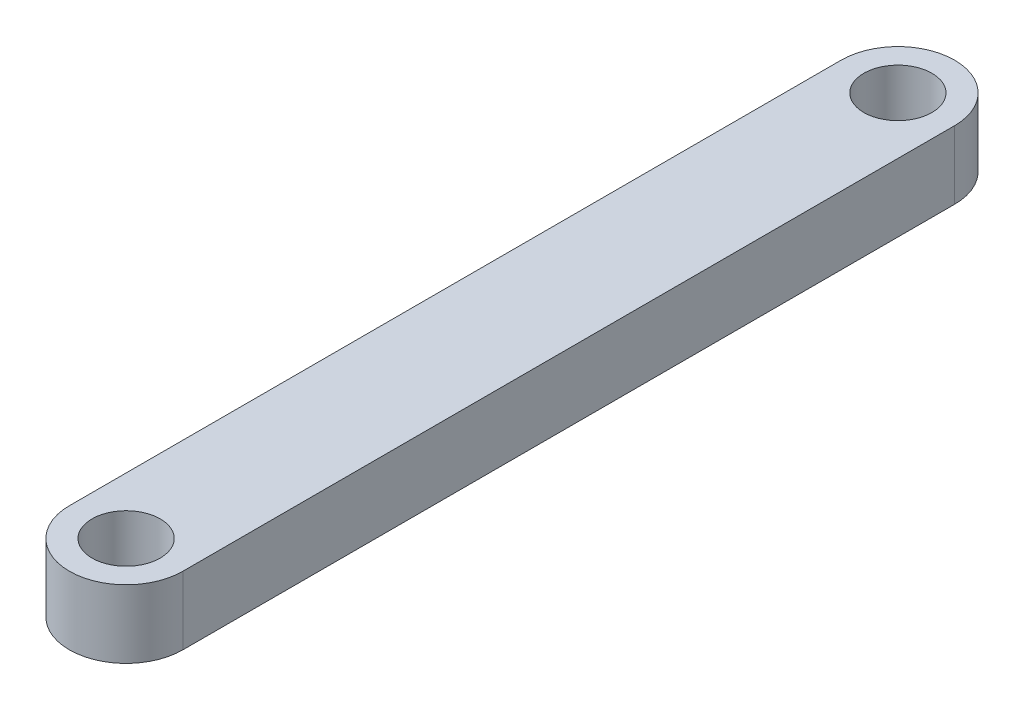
ISO-10303-21;
HEADER;
FILE_DESCRIPTION(('STEP AP214'),'2;1');
FILE_NAME('part.step','',(''),(''),'','','');
FILE_SCHEMA(('AUTOMOTIVE_DESIGN { 1 0 10303 214 1 1 1 1 }'));
ENDSEC;
DATA;
#1=APPLICATION_CONTEXT('core data for automotive mechanical design processes');
#2=APPLICATION_PROTOCOL_DEFINITION('international standard','automotive_design',2000,#1);
#3=PRODUCT_CONTEXT('',#1,'mechanical');
#4=PRODUCT('Part','Part','',(#3));
#5=PRODUCT_RELATED_PRODUCT_CATEGORY('part','',(#4));
#6=PRODUCT_DEFINITION_FORMATION('','',#4);
#7=PRODUCT_DEFINITION_CONTEXT('part definition',#1,'design');
#8=PRODUCT_DEFINITION('design','',#6,#7);
#9=PRODUCT_DEFINITION_SHAPE('','',#8);
#10=(LENGTH_UNIT() NAMED_UNIT(*) SI_UNIT(.MILLI.,.METRE.));
#11=(NAMED_UNIT(*) PLANE_ANGLE_UNIT() SI_UNIT($,.RADIAN.));
#12=(NAMED_UNIT(*) SI_UNIT($,.STERADIAN.) SOLID_ANGLE_UNIT());
#13=UNCERTAINTY_MEASURE_WITH_UNIT(LENGTH_MEASURE(1.E-05),#10,'distance_accuracy_value','');
#14=(GEOMETRIC_REPRESENTATION_CONTEXT(3) GLOBAL_UNCERTAINTY_ASSIGNED_CONTEXT((#13)) GLOBAL_UNIT_ASSIGNED_CONTEXT((#10,
#11,#12)) REPRESENTATION_CONTEXT('',''));
#15=CARTESIAN_POINT('',(0.,0.,0.));
#16=DIRECTION('',(0.,0.,1.));
#17=DIRECTION('',(1.,0.,0.));
#18=AXIS2_PLACEMENT_3D('',#15,#16,#17);
#19=CARTESIAN_POINT('',(0.,3.,-34.));
#20=DIRECTION('',(0.,1.,0.));
#21=DIRECTION('',(0.,0.,1.));
#22=AXIS2_PLACEMENT_3D('',#19,#20,#21);
#23=PLANE('',#22);
#24=CARTESIAN_POINT('',(0.,3.,0.));
#25=DIRECTION('',(0.,1.,0.));
#26=DIRECTION('',(0.,0.,1.));
#27=AXIS2_PLACEMENT_3D('',#24,#25,#26);
#28=CIRCLE('',#27,1.5);
#29=CARTESIAN_POINT('',(0.,3.,1.5));
#30=VERTEX_POINT('',#29);
#31=EDGE_CURVE('E100',#30,#30,#28,.T.);
#32=ORIENTED_EDGE('',*,*,#31,.F.);
#33=EDGE_LOOP('',(#32));
#34=FACE_BOUND('',#33,.T.);
#35=CARTESIAN_POINT('',(0.,3.,-34.));
#36=DIRECTION('',(0.,1.,0.));
#37=DIRECTION('',(0.,0.,1.));
#38=AXIS2_PLACEMENT_3D('',#35,#36,#37);
#39=CIRCLE('',#38,2.5);
#40=CARTESIAN_POINT('',(2.5,3.,-34.));
#41=VERTEX_POINT('',#40);
#42=CARTESIAN_POINT('',(-2.5,3.,-34.));
#43=VERTEX_POINT('',#42);
#44=EDGE_CURVE('E85',#41,#43,#39,.T.);
#45=ORIENTED_EDGE('',*,*,#44,.T.);
#46=DIRECTION('',(0.,0.,1.));
#47=VECTOR('',#46,1.);
#48=CARTESIAN_POINT('',(-2.5,3.,-34.));
#49=LINE('',#48,#47);
#50=CARTESIAN_POINT('',(-2.5,3.,0.));
#51=VERTEX_POINT('',#50);
#52=EDGE_CURVE('E80',#43,#51,#49,.T.);
#53=ORIENTED_EDGE('',*,*,#52,.T.);
#54=CARTESIAN_POINT('',(0.,3.,0.));
#55=DIRECTION('',(0.,1.,0.));
#56=DIRECTION('',(0.,0.,1.));
#57=AXIS2_PLACEMENT_3D('',#54,#55,#56);
#58=CIRCLE('',#57,2.5);
#59=CARTESIAN_POINT('',(2.5,3.,0.));
#60=VERTEX_POINT('',#59);
#61=EDGE_CURVE('E83',#51,#60,#58,.T.);
#62=ORIENTED_EDGE('',*,*,#61,.T.);
#63=DIRECTION('',(0.,0.,-1.));
#64=VECTOR('',#63,1.);
#65=CARTESIAN_POINT('',(2.5,3.,-34.));
#66=LINE('',#65,#64);
#67=EDGE_CURVE('E50',#60,#41,#66,.T.);
#68=ORIENTED_EDGE('',*,*,#67,.T.);
#69=EDGE_LOOP('',(#45,#53,#62,#68));
#70=FACE_BOUND('',#69,.T.);
#71=CARTESIAN_POINT('',(0.,3.,-34.));
#72=DIRECTION('',(0.,1.,0.));
#73=DIRECTION('',(0.,0.,1.));
#74=AXIS2_PLACEMENT_3D('',#71,#72,#73);
#75=CIRCLE('',#74,1.5);
#76=CARTESIAN_POINT('',(0.,3.,-32.5));
#77=VERTEX_POINT('',#76);
#78=EDGE_CURVE('E115',#77,#77,#75,.T.);
#79=ORIENTED_EDGE('',*,*,#78,.F.);
#80=EDGE_LOOP('',(#79));
#81=FACE_BOUND('',#80,.T.);
#82=ADVANCED_FACE('F33',(#34,#70,#81),#23,.T.);
#83=CARTESIAN_POINT('',(0.,0.,-34.));
#84=DIRECTION('',(0.,1.,0.));
#85=DIRECTION('',(0.,0.,1.));
#86=AXIS2_PLACEMENT_3D('',#83,#84,#85);
#87=PLANE('',#86);
#88=CARTESIAN_POINT('',(0.,0.,-34.));
#89=DIRECTION('',(0.,1.,0.));
#90=DIRECTION('',(0.,0.,1.));
#91=AXIS2_PLACEMENT_3D('',#88,#89,#90);
#92=CIRCLE('',#91,2.5);
#93=CARTESIAN_POINT('',(2.5,0.,-34.));
#94=VERTEX_POINT('',#93);
#95=CARTESIAN_POINT('',(-2.5,0.,-34.));
#96=VERTEX_POINT('',#95);
#97=EDGE_CURVE('E97',#94,#96,#92,.T.);
#98=ORIENTED_EDGE('',*,*,#97,.F.);
#99=DIRECTION('',(0.,0.,-1.));
#100=VECTOR('',#99,1.);
#101=CARTESIAN_POINT('',(2.5,0.,-34.));
#102=LINE('',#101,#100);
#103=CARTESIAN_POINT('',(2.5,0.,0.));
#104=VERTEX_POINT('',#103);
#105=EDGE_CURVE('E73',#104,#94,#102,.T.);
#106=ORIENTED_EDGE('',*,*,#105,.F.);
#107=CARTESIAN_POINT('',(0.,0.,0.));
#108=DIRECTION('',(0.,1.,0.));
#109=DIRECTION('',(0.,0.,1.));
#110=AXIS2_PLACEMENT_3D('',#107,#108,#109);
#111=CIRCLE('',#110,2.5);
#112=CARTESIAN_POINT('',(-2.5,0.,0.));
#113=VERTEX_POINT('',#112);
#114=EDGE_CURVE('E67',#113,#104,#111,.T.);
#115=ORIENTED_EDGE('',*,*,#114,.F.);
#116=DIRECTION('',(0.,0.,1.));
#117=VECTOR('',#116,1.);
#118=CARTESIAN_POINT('',(-2.5,0.,-34.));
#119=LINE('',#118,#117);
#120=EDGE_CURVE('E89',#96,#113,#119,.T.);
#121=ORIENTED_EDGE('',*,*,#120,.F.);
#122=EDGE_LOOP('',(#98,#106,#115,#121));
#123=FACE_BOUND('',#122,.T.);
#124=CARTESIAN_POINT('',(0.,0.,0.));
#125=DIRECTION('',(0.,1.,0.));
#126=DIRECTION('',(0.,0.,1.));
#127=AXIS2_PLACEMENT_3D('',#124,#125,#126);
#128=CIRCLE('',#127,1.5);
#129=CARTESIAN_POINT('',(0.,0.,1.5));
#130=VERTEX_POINT('',#129);
#131=EDGE_CURVE('E112',#130,#130,#128,.T.);
#132=ORIENTED_EDGE('',*,*,#131,.T.);
#133=EDGE_LOOP('',(#132));
#134=FACE_BOUND('',#133,.T.);
#135=CARTESIAN_POINT('',(0.,0.,-34.));
#136=DIRECTION('',(0.,1.,0.));
#137=DIRECTION('',(0.,0.,1.));
#138=AXIS2_PLACEMENT_3D('',#135,#136,#137);
#139=CIRCLE('',#138,1.5);
#140=CARTESIAN_POINT('',(0.,0.,-32.5));
#141=VERTEX_POINT('',#140);
#142=EDGE_CURVE('E118',#141,#141,#139,.T.);
#143=ORIENTED_EDGE('',*,*,#142,.T.);
#144=EDGE_LOOP('',(#143));
#145=FACE_BOUND('',#144,.T.);
#146=ADVANCED_FACE('F108',(#123,#134,#145),#87,.F.);
#147=CARTESIAN_POINT('',(0.,3.,-34.));
#148=DIRECTION('',(0.,-1.,0.));
#149=DIRECTION('',(0.,0.,-1.));
#150=AXIS2_PLACEMENT_3D('',#147,#148,#149);
#151=CYLINDRICAL_SURFACE('',#150,2.5);
#152=ORIENTED_EDGE('',*,*,#97,.T.);
#153=DIRECTION('',(0.,-1.,0.));
#154=VECTOR('',#153,1.);
#155=CARTESIAN_POINT('',(-2.5,3.,-34.));
#156=LINE('',#155,#154);
#157=EDGE_CURVE('E11',#43,#96,#156,.T.);
#158=ORIENTED_EDGE('',*,*,#157,.F.);
#159=ORIENTED_EDGE('',*,*,#44,.F.);
#160=DIRECTION('',(0.,-1.,0.));
#161=VECTOR('',#160,1.);
#162=CARTESIAN_POINT('',(2.5,3.,-34.));
#163=LINE('',#162,#161);
#164=EDGE_CURVE('E93',#41,#94,#163,.T.);
#165=ORIENTED_EDGE('',*,*,#164,.T.);
#166=EDGE_LOOP('',(#152,#158,#159,#165));
#167=FACE_BOUND('',#166,.T.);
#168=ADVANCED_FACE('F35',(#167),#151,.T.);
#169=CARTESIAN_POINT('',(-2.5,3.,-34.));
#170=DIRECTION('',(1.,0.,0.));
#171=DIRECTION('',(0.,0.,-1.));
#172=AXIS2_PLACEMENT_3D('',#169,#170,#171);
#173=PLANE('',#172);
#174=ORIENTED_EDGE('',*,*,#120,.T.);
#175=DIRECTION('',(0.,-1.,0.));
#176=VECTOR('',#175,1.);
#177=CARTESIAN_POINT('',(-2.5,3.,0.));
#178=LINE('',#177,#176);
#179=EDGE_CURVE('E42',#51,#113,#178,.T.);
#180=ORIENTED_EDGE('',*,*,#179,.F.);
#181=ORIENTED_EDGE('',*,*,#52,.F.);
#182=ORIENTED_EDGE('',*,*,#157,.T.);
#183=EDGE_LOOP('',(#174,#180,#181,#182));
#184=FACE_BOUND('',#183,.T.);
#185=ADVANCED_FACE('F88',(#184),#173,.F.);
#186=CARTESIAN_POINT('',(0.,3.,0.));
#187=DIRECTION('',(0.,-1.,0.));
#188=DIRECTION('',(0.,0.,-1.));
#189=AXIS2_PLACEMENT_3D('',#186,#187,#188);
#190=CYLINDRICAL_SURFACE('',#189,2.5);
#191=ORIENTED_EDGE('',*,*,#114,.T.);
#192=DIRECTION('',(0.,-1.,0.));
#193=VECTOR('',#192,1.);
#194=CARTESIAN_POINT('',(2.5,3.,0.));
#195=LINE('',#194,#193);
#196=EDGE_CURVE('E90',#60,#104,#195,.T.);
#197=ORIENTED_EDGE('',*,*,#196,.F.);
#198=ORIENTED_EDGE('',*,*,#61,.F.);
#199=ORIENTED_EDGE('',*,*,#179,.T.);
#200=EDGE_LOOP('',(#191,#197,#198,#199));
#201=FACE_BOUND('',#200,.T.);
#202=ADVANCED_FACE('F91',(#201),#190,.T.);
#203=CARTESIAN_POINT('',(2.5,3.,-34.));
#204=DIRECTION('',(-1.,0.,0.));
#205=DIRECTION('',(0.,0.,1.));
#206=AXIS2_PLACEMENT_3D('',#203,#204,#205);
#207=PLANE('',#206);
#208=ORIENTED_EDGE('',*,*,#105,.T.);
#209=ORIENTED_EDGE('',*,*,#164,.F.);
#210=ORIENTED_EDGE('',*,*,#67,.F.);
#211=ORIENTED_EDGE('',*,*,#196,.T.);
#212=EDGE_LOOP('',(#208,#209,#210,#211));
#213=FACE_BOUND('',#212,.T.);
#214=ADVANCED_FACE('F105',(#213),#207,.F.);
#215=CARTESIAN_POINT('',(0.,3.,0.));
#216=DIRECTION('',(0.,-1.,0.));
#217=DIRECTION('',(0.,0.,-1.));
#218=AXIS2_PLACEMENT_3D('',#215,#216,#217);
#219=CYLINDRICAL_SURFACE('',#218,1.5);
#220=ORIENTED_EDGE('',*,*,#31,.T.);
#221=EDGE_LOOP('',(#220));
#222=FACE_BOUND('',#221,.T.);
#223=ORIENTED_EDGE('',*,*,#131,.F.);
#224=EDGE_LOOP('',(#223));
#225=FACE_BOUND('',#224,.T.);
#226=ADVANCED_FACE('F135',(#222,#225),#219,.F.);
#227=CARTESIAN_POINT('',(0.,3.,-34.));
#228=DIRECTION('',(0.,-1.,0.));
#229=DIRECTION('',(0.,0.,-1.));
#230=AXIS2_PLACEMENT_3D('',#227,#228,#229);
#231=CYLINDRICAL_SURFACE('',#230,1.5);
#232=ORIENTED_EDGE('',*,*,#78,.T.);
#233=EDGE_LOOP('',(#232));
#234=FACE_BOUND('',#233,.T.);
#235=ORIENTED_EDGE('',*,*,#142,.F.);
#236=EDGE_LOOP('',(#235));
#237=FACE_BOUND('',#236,.T.);
#238=ADVANCED_FACE('F124',(#234,#237),#231,.F.);
#239=CLOSED_SHELL('',(#82,#146,#168,#185,#202,#214,#226,#238));
#240=MANIFOLD_SOLID_BREP('B2',#239);
#241=ADVANCED_BREP_SHAPE_REPRESENTATION('',(#18,#240),#14);
#242=SHAPE_DEFINITION_REPRESENTATION(#9,#241);
ENDSEC;
END-ISO-10303-21;
